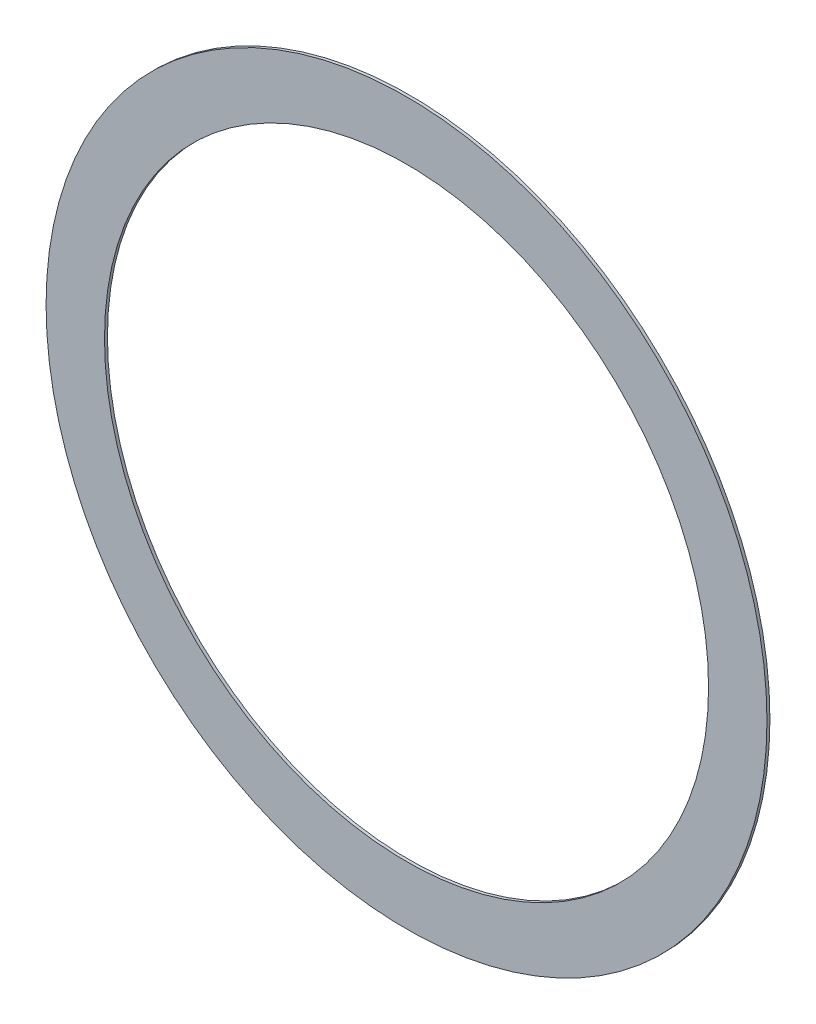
ISO-10303-21;
HEADER;
FILE_DESCRIPTION(('STEP AP214'),'2;1');
FILE_NAME('part.step','',(''),(''),'','','');
FILE_SCHEMA(('AUTOMOTIVE_DESIGN { 1 0 10303 214 1 1 1 1 }'));
ENDSEC;
DATA;
#1=APPLICATION_CONTEXT('core data for automotive mechanical design processes');
#2=APPLICATION_PROTOCOL_DEFINITION('international standard','automotive_design',2000,#1);
#3=PRODUCT_CONTEXT('',#1,'mechanical');
#4=PRODUCT('Part','Part','',(#3));
#5=PRODUCT_RELATED_PRODUCT_CATEGORY('part','',(#4));
#6=PRODUCT_DEFINITION_FORMATION('','',#4);
#7=PRODUCT_DEFINITION_CONTEXT('part definition',#1,'design');
#8=PRODUCT_DEFINITION('design','',#6,#7);
#9=PRODUCT_DEFINITION_SHAPE('','',#8);
#10=(LENGTH_UNIT() NAMED_UNIT(*) SI_UNIT(.MILLI.,.METRE.));
#11=(NAMED_UNIT(*) PLANE_ANGLE_UNIT() SI_UNIT($,.RADIAN.));
#12=(NAMED_UNIT(*) SI_UNIT($,.STERADIAN.) SOLID_ANGLE_UNIT());
#13=UNCERTAINTY_MEASURE_WITH_UNIT(LENGTH_MEASURE(1.E-05),#10,'distance_accuracy_value','');
#14=(GEOMETRIC_REPRESENTATION_CONTEXT(3) GLOBAL_UNCERTAINTY_ASSIGNED_CONTEXT((#13)) GLOBAL_UNIT_ASSIGNED_CONTEXT((#10,
#11,#12)) REPRESENTATION_CONTEXT('',''));
#15=CARTESIAN_POINT('',(0.,0.,0.));
#16=DIRECTION('',(0.,0.,1.));
#17=DIRECTION('',(1.,0.,0.));
#18=AXIS2_PLACEMENT_3D('',#15,#16,#17);
#19=CARTESIAN_POINT('',(0.,0.,0.55));
#20=DIRECTION('',(0.,0.,1.));
#21=DIRECTION('',(1.,0.,0.));
#22=AXIS2_PLACEMENT_3D('',#19,#20,#21);
#23=PLANE('',#22);
#24=CARTESIAN_POINT('',(0.,0.,0.55));
#25=DIRECTION('',(0.,0.,1.));
#26=DIRECTION('',(1.,0.,0.));
#27=AXIS2_PLACEMENT_3D('',#24,#25,#26);
#28=CIRCLE('',#27,66.95);
#29=CARTESIAN_POINT('',(66.95,0.,0.55));
#30=VERTEX_POINT('',#29);
#31=EDGE_CURVE('E10',#30,#30,#28,.T.);
#32=ORIENTED_EDGE('',*,*,#31,.T.);
#33=EDGE_LOOP('',(#32));
#34=FACE_BOUND('',#33,.T.);
#35=CARTESIAN_POINT('',(0.,0.,0.55));
#36=DIRECTION('',(0.,0.,1.));
#37=DIRECTION('',(1.,0.,0.));
#38=AXIS2_PLACEMENT_3D('',#35,#36,#37);
#39=CIRCLE('',#38,56.1);
#40=CARTESIAN_POINT('',(56.1,0.,0.55));
#41=VERTEX_POINT('',#40);
#42=EDGE_CURVE('E45',#41,#41,#39,.T.);
#43=ORIENTED_EDGE('',*,*,#42,.F.);
#44=EDGE_LOOP('',(#43));
#45=FACE_BOUND('',#44,.T.);
#46=ADVANCED_FACE('F34',(#34,#45),#23,.T.);
#47=CARTESIAN_POINT('',(0.,0.,0.));
#48=DIRECTION('',(0.,0.,1.));
#49=DIRECTION('',(1.,0.,0.));
#50=AXIS2_PLACEMENT_3D('',#47,#48,#49);
#51=PLANE('',#50);
#52=CARTESIAN_POINT('',(0.,0.,0.));
#53=DIRECTION('',(0.,0.,1.));
#54=DIRECTION('',(1.,0.,0.));
#55=AXIS2_PLACEMENT_3D('',#52,#53,#54);
#56=CIRCLE('',#55,66.95);
#57=CARTESIAN_POINT('',(66.95,0.,0.));
#58=VERTEX_POINT('',#57);
#59=EDGE_CURVE('E38',#58,#58,#56,.T.);
#60=ORIENTED_EDGE('',*,*,#59,.F.);
#61=EDGE_LOOP('',(#60));
#62=FACE_BOUND('',#61,.T.);
#63=CARTESIAN_POINT('',(0.,0.,0.));
#64=DIRECTION('',(0.,0.,1.));
#65=DIRECTION('',(1.,0.,0.));
#66=AXIS2_PLACEMENT_3D('',#63,#64,#65);
#67=CIRCLE('',#66,56.1);
#68=CARTESIAN_POINT('',(56.1,0.,0.));
#69=VERTEX_POINT('',#68);
#70=EDGE_CURVE('E47',#69,#69,#67,.T.);
#71=ORIENTED_EDGE('',*,*,#70,.T.);
#72=EDGE_LOOP('',(#71));
#73=FACE_BOUND('',#72,.T.);
#74=ADVANCED_FACE('F57',(#62,#73),#51,.F.);
#75=CARTESIAN_POINT('',(0.,0.,0.55));
#76=DIRECTION('',(0.,0.,-1.));
#77=DIRECTION('',(-1.,0.,0.));
#78=AXIS2_PLACEMENT_3D('',#75,#76,#77);
#79=CYLINDRICAL_SURFACE('',#78,66.95);
#80=ORIENTED_EDGE('',*,*,#31,.F.);
#81=EDGE_LOOP('',(#80));
#82=FACE_BOUND('',#81,.T.);
#83=ORIENTED_EDGE('',*,*,#59,.T.);
#84=EDGE_LOOP('',(#83));
#85=FACE_BOUND('',#84,.T.);
#86=ADVANCED_FACE('F36',(#82,#85),#79,.T.);
#87=CARTESIAN_POINT('',(0.,0.,0.55));
#88=DIRECTION('',(0.,0.,-1.));
#89=DIRECTION('',(-1.,0.,0.));
#90=AXIS2_PLACEMENT_3D('',#87,#88,#89);
#91=CYLINDRICAL_SURFACE('',#90,56.1);
#92=ORIENTED_EDGE('',*,*,#42,.T.);
#93=EDGE_LOOP('',(#92));
#94=FACE_BOUND('',#93,.T.);
#95=ORIENTED_EDGE('',*,*,#70,.F.);
#96=EDGE_LOOP('',(#95));
#97=FACE_BOUND('',#96,.T.);
#98=ADVANCED_FACE('F53',(#94,#97),#91,.F.);
#99=CLOSED_SHELL('',(#46,#74,#86,#98));
#100=MANIFOLD_SOLID_BREP('B2',#99);
#101=ADVANCED_BREP_SHAPE_REPRESENTATION('',(#18,#100),#14);
#102=SHAPE_DEFINITION_REPRESENTATION(#9,#101);
ENDSEC;
END-ISO-10303-21;
